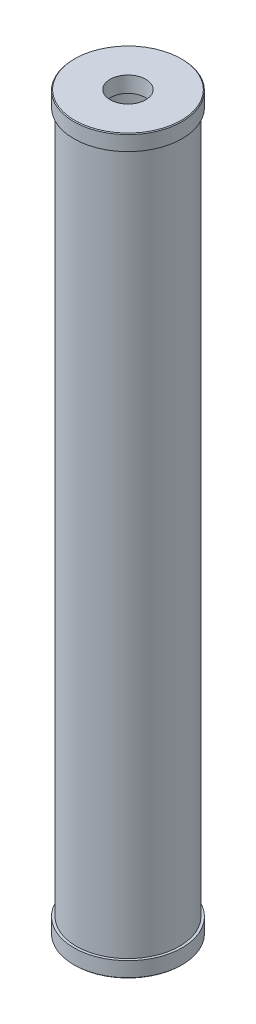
ISO-10303-21;
HEADER;
FILE_DESCRIPTION(('STEP AP214'),'2;1');
FILE_NAME('part.step','',(''),(''),'','','');
FILE_SCHEMA(('AUTOMOTIVE_DESIGN { 1 0 10303 214 1 1 1 1 }'));
ENDSEC;
DATA;
#1=APPLICATION_CONTEXT('core data for automotive mechanical design processes');
#2=APPLICATION_PROTOCOL_DEFINITION('international standard','automotive_design',2000,#1);
#3=PRODUCT_CONTEXT('',#1,'mechanical');
#4=PRODUCT('Part','Part','',(#3));
#5=PRODUCT_RELATED_PRODUCT_CATEGORY('part','',(#4));
#6=PRODUCT_DEFINITION_FORMATION('','',#4);
#7=PRODUCT_DEFINITION_CONTEXT('part definition',#1,'design');
#8=PRODUCT_DEFINITION('design','',#6,#7);
#9=PRODUCT_DEFINITION_SHAPE('','',#8);
#10=(LENGTH_UNIT() NAMED_UNIT(*) SI_UNIT(.MILLI.,.METRE.));
#11=(NAMED_UNIT(*) PLANE_ANGLE_UNIT() SI_UNIT($,.RADIAN.));
#12=(NAMED_UNIT(*) SI_UNIT($,.STERADIAN.) SOLID_ANGLE_UNIT());
#13=UNCERTAINTY_MEASURE_WITH_UNIT(LENGTH_MEASURE(1.E-05),#10,'distance_accuracy_value','');
#14=(GEOMETRIC_REPRESENTATION_CONTEXT(3) GLOBAL_UNCERTAINTY_ASSIGNED_CONTEXT((#13)) GLOBAL_UNIT_ASSIGNED_CONTEXT((#10,
#11,#12)) REPRESENTATION_CONTEXT('',''));
#15=CARTESIAN_POINT('',(0.,0.,0.));
#16=DIRECTION('',(0.,0.,1.));
#17=DIRECTION('',(1.,0.,0.));
#18=AXIS2_PLACEMENT_3D('',#15,#16,#17);
#19=CARTESIAN_POINT('',(0.,25.4,0.));
#20=DIRECTION('',(0.,1.,0.));
#21=DIRECTION('',(0.,0.,1.));
#22=AXIS2_PLACEMENT_3D('',#19,#20,#21);
#23=PLANE('',#22);
#24=CARTESIAN_POINT('',(0.,25.4,0.));
#25=DIRECTION('',(0.,1.,0.));
#26=DIRECTION('',(0.,0.,1.));
#27=AXIS2_PLACEMENT_3D('',#24,#25,#26);
#28=CIRCLE('',#27,28.2731618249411);
#29=CARTESIAN_POINT('',(0.,25.4,28.2731618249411));
#30=VERTEX_POINT('',#29);
#31=EDGE_CURVE('E77',#30,#30,#28,.T.);
#32=ORIENTED_EDGE('',*,*,#31,.F.);
#33=EDGE_LOOP('',(#32));
#34=FACE_BOUND('',#33,.T.);
#35=CARTESIAN_POINT('',(0.,25.4000000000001,0.));
#36=DIRECTION('',(0.,1.,0.));
#37=DIRECTION('',(0.,0.,1.));
#38=AXIS2_PLACEMENT_3D('',#35,#36,#37);
#39=CIRCLE('',#38,74.676);
#40=CARTESIAN_POINT('',(0.,25.4000000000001,74.676));
#41=VERTEX_POINT('',#40);
#42=EDGE_CURVE('E63',#41,#41,#39,.T.);
#43=ORIENTED_EDGE('',*,*,#42,.T.);
#44=EDGE_LOOP('',(#43));
#45=FACE_BOUND('',#44,.T.);
#46=ADVANCED_FACE('F33',(#34,#45),#23,.T.);
#47=CARTESIAN_POINT('',(0.,1193.8,0.));
#48=DIRECTION('',(0.,-1.,0.));
#49=DIRECTION('',(0.,0.,-1.));
#50=AXIS2_PLACEMENT_3D('',#47,#48,#49);
#51=CYLINDRICAL_SURFACE('',#50,74.676);
#52=ORIENTED_EDGE('',*,*,#42,.F.);
#53=EDGE_LOOP('',(#52));
#54=FACE_BOUND('',#53,.T.);
#55=CARTESIAN_POINT('',(0.,1168.4,0.));
#56=DIRECTION('',(0.,1.,0.));
#57=DIRECTION('',(0.,0.,1.));
#58=AXIS2_PLACEMENT_3D('',#55,#56,#57);
#59=CIRCLE('',#58,74.676);
#60=CARTESIAN_POINT('',(0.,1168.4,74.676));
#61=VERTEX_POINT('',#60);
#62=EDGE_CURVE('E59',#61,#61,#59,.T.);
#63=ORIENTED_EDGE('',*,*,#62,.T.);
#64=EDGE_LOOP('',(#63));
#65=FACE_BOUND('',#64,.T.);
#66=ADVANCED_FACE('F106',(#54,#65),#51,.F.);
#67=CARTESIAN_POINT('',(0.,1168.4,0.));
#68=DIRECTION('',(0.,1.,0.));
#69=DIRECTION('',(0.,0.,1.));
#70=AXIS2_PLACEMENT_3D('',#67,#68,#69);
#71=PLANE('',#70);
#72=CARTESIAN_POINT('',(0.,1168.4,0.));
#73=DIRECTION('',(0.,1.,0.));
#74=DIRECTION('',(0.,0.,1.));
#75=AXIS2_PLACEMENT_3D('',#72,#73,#74);
#76=CIRCLE('',#75,28.2731618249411);
#77=CARTESIAN_POINT('',(0.,1168.4,28.2731618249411));
#78=VERTEX_POINT('',#77);
#79=EDGE_CURVE('E54',#78,#78,#76,.T.);
#80=ORIENTED_EDGE('',*,*,#79,.T.);
#81=EDGE_LOOP('',(#80));
#82=FACE_BOUND('',#81,.T.);
#83=ORIENTED_EDGE('',*,*,#62,.F.);
#84=EDGE_LOOP('',(#83));
#85=FACE_BOUND('',#84,.T.);
#86=ADVANCED_FACE('F99',(#82,#85),#71,.F.);
#87=CARTESIAN_POINT('',(0.,1193.8,0.));
#88=DIRECTION('',(0.,1.,0.));
#89=DIRECTION('',(0.,0.,1.));
#90=AXIS2_PLACEMENT_3D('',#87,#88,#89);
#91=CONICAL_SURFACE('',#90,29.066064,0.0312064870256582);
#92=CARTESIAN_POINT('',(0.,1193.8,0.));
#93=DIRECTION('',(0.,1.,0.));
#94=DIRECTION('',(0.,0.,1.));
#95=AXIS2_PLACEMENT_3D('',#92,#93,#94);
#96=CIRCLE('',#95,29.066064);
#97=CARTESIAN_POINT('',(0.,1193.8,29.066064));
#98=VERTEX_POINT('',#97);
#99=EDGE_CURVE('E58',#98,#98,#96,.T.);
#100=ORIENTED_EDGE('',*,*,#99,.T.);
#101=EDGE_LOOP('',(#100));
#102=FACE_BOUND('',#101,.T.);
#103=ORIENTED_EDGE('',*,*,#79,.F.);
#104=EDGE_LOOP('',(#103));
#105=FACE_BOUND('',#104,.T.);
#106=ADVANCED_FACE('F123',(#102,#105),#91,.F.);
#107=CARTESIAN_POINT('',(0.,1193.8,0.));
#108=DIRECTION('',(0.,-1.,0.));
#109=DIRECTION('',(0.,0.,-1.));
#110=AXIS2_PLACEMENT_3D('',#107,#108,#109);
#111=CYLINDRICAL_SURFACE('',#110,84.201);
#112=CARTESIAN_POINT('',(0.,25.4000000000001,0.));
#113=DIRECTION('',(0.,1.,0.));
#114=DIRECTION('',(0.,0.,1.));
#115=AXIS2_PLACEMENT_3D('',#112,#113,#114);
#116=CIRCLE('',#115,84.201);
#117=CARTESIAN_POINT('',(0.,25.4000000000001,84.201));
#118=VERTEX_POINT('',#117);
#119=EDGE_CURVE('E66',#118,#118,#116,.T.);
#120=ORIENTED_EDGE('',*,*,#119,.T.);
#121=EDGE_LOOP('',(#120));
#122=FACE_BOUND('',#121,.T.);
#123=CARTESIAN_POINT('',(0.,1168.4,0.));
#124=DIRECTION('',(0.,1.,0.));
#125=DIRECTION('',(0.,0.,1.));
#126=AXIS2_PLACEMENT_3D('',#123,#124,#125);
#127=CIRCLE('',#126,84.201);
#128=CARTESIAN_POINT('',(0.,1168.4,84.201));
#129=VERTEX_POINT('',#128);
#130=EDGE_CURVE('E53',#129,#129,#127,.T.);
#131=ORIENTED_EDGE('',*,*,#130,.F.);
#132=EDGE_LOOP('',(#131));
#133=FACE_BOUND('',#132,.T.);
#134=ADVANCED_FACE('F118',(#122,#133),#111,.T.);
#135=CARTESIAN_POINT('',(0.,25.4,0.));
#136=DIRECTION('',(0.,1.,0.));
#137=DIRECTION('',(0.,0.,1.));
#138=AXIS2_PLACEMENT_3D('',#135,#136,#137);
#139=CIRCLE('',#138,88.265);
#140=CARTESIAN_POINT('',(0.,25.4,88.265));
#141=VERTEX_POINT('',#140);
#142=EDGE_CURVE('E62',#141,#141,#139,.T.);
#143=ORIENTED_EDGE('',*,*,#142,.T.);
#144=EDGE_LOOP('',(#143));
#145=FACE_BOUND('',#144,.T.);
#146=ORIENTED_EDGE('',*,*,#119,.F.);
#147=EDGE_LOOP('',(#146));
#148=FACE_BOUND('',#147,.T.);
#149=ADVANCED_FACE('F100',(#145,#148),#23,.T.);
#150=CARTESIAN_POINT('',(0.,25.4,0.));
#151=DIRECTION('',(0.,-1.,0.));
#152=DIRECTION('',(0.,0.,-1.));
#153=AXIS2_PLACEMENT_3D('',#150,#151,#152);
#154=CYLINDRICAL_SURFACE('',#153,88.265);
#155=CARTESIAN_POINT('',(0.,1.27000000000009,0.));
#156=DIRECTION('',(0.,1.,0.));
#157=DIRECTION('',(0.,0.,1.));
#158=AXIS2_PLACEMENT_3D('',#155,#156,#157);
#159=CIRCLE('',#158,88.265);
#160=CARTESIAN_POINT('',(0.,1.27000000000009,88.265));
#161=VERTEX_POINT('',#160);
#162=EDGE_CURVE('E48',#161,#161,#159,.T.);
#163=ORIENTED_EDGE('',*,*,#162,.T.);
#164=EDGE_LOOP('',(#163));
#165=FACE_BOUND('',#164,.T.);
#166=ORIENTED_EDGE('',*,*,#142,.F.);
#167=EDGE_LOOP('',(#166));
#168=FACE_BOUND('',#167,.T.);
#169=ADVANCED_FACE('F89',(#165,#168),#154,.T.);
#170=CARTESIAN_POINT('',(0.,0.,0.));
#171=DIRECTION('',(0.,1.,0.));
#172=DIRECTION('',(0.,0.,1.));
#173=AXIS2_PLACEMENT_3D('',#170,#171,#172);
#174=PLANE('',#173);
#175=CARTESIAN_POINT('',(0.,0.,0.));
#176=DIRECTION('',(0.,1.,0.));
#177=DIRECTION('',(0.,0.,1.));
#178=AXIS2_PLACEMENT_3D('',#175,#176,#177);
#179=CIRCLE('',#178,86.9949999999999);
#180=CARTESIAN_POINT('',(0.,0.,86.9949999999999));
#181=VERTEX_POINT('',#180);
#182=EDGE_CURVE('E44',#181,#181,#179,.F.);
#183=ORIENTED_EDGE('',*,*,#182,.T.);
#184=EDGE_LOOP('',(#183));
#185=FACE_BOUND('',#184,.T.);
#186=CARTESIAN_POINT('',(0.,0.,0.));
#187=DIRECTION('',(0.,-1.,0.));
#188=DIRECTION('',(0.,0.,-1.));
#189=AXIS2_PLACEMENT_3D('',#186,#187,#188);
#190=CIRCLE('',#189,29.066064);
#191=CARTESIAN_POINT('',(0.,0.,-29.066064));
#192=VERTEX_POINT('',#191);
#193=EDGE_CURVE('E80',#192,#192,#190,.T.);
#194=ORIENTED_EDGE('',*,*,#193,.F.);
#195=EDGE_LOOP('',(#194));
#196=FACE_BOUND('',#195,.T.);
#197=ADVANCED_FACE('F86',(#185,#196),#174,.F.);
#198=CARTESIAN_POINT('',(0.,1168.4,0.));
#199=DIRECTION('',(0.,1.,0.));
#200=DIRECTION('',(0.,0.,1.));
#201=AXIS2_PLACEMENT_3D('',#198,#199,#200);
#202=CIRCLE('',#201,88.265);
#203=CARTESIAN_POINT('',(0.,1168.4,88.265));
#204=VERTEX_POINT('',#203);
#205=EDGE_CURVE('E57',#204,#204,#202,.T.);
#206=ORIENTED_EDGE('',*,*,#205,.F.);
#207=EDGE_LOOP('',(#206));
#208=FACE_BOUND('',#207,.T.);
#209=ORIENTED_EDGE('',*,*,#130,.T.);
#210=EDGE_LOOP('',(#209));
#211=FACE_BOUND('',#210,.T.);
#212=ADVANCED_FACE('F88',(#208,#211),#71,.F.);
#213=CARTESIAN_POINT('',(0.,1168.4,0.));
#214=DIRECTION('',(0.,1.,0.));
#215=DIRECTION('',(0.,0.,1.));
#216=AXIS2_PLACEMENT_3D('',#213,#214,#215);
#217=CYLINDRICAL_SURFACE('',#216,88.265);
#218=CARTESIAN_POINT('',(0.,1192.53,0.));
#219=DIRECTION('',(0.,1.,0.));
#220=DIRECTION('',(0.,0.,1.));
#221=AXIS2_PLACEMENT_3D('',#218,#219,#220);
#222=CIRCLE('',#221,88.265);
#223=CARTESIAN_POINT('',(0.,1192.53,88.265));
#224=VERTEX_POINT('',#223);
#225=EDGE_CURVE('E10',#224,#224,#222,.F.);
#226=ORIENTED_EDGE('',*,*,#225,.T.);
#227=EDGE_LOOP('',(#226));
#228=FACE_BOUND('',#227,.T.);
#229=ORIENTED_EDGE('',*,*,#205,.T.);
#230=EDGE_LOOP('',(#229));
#231=FACE_BOUND('',#230,.T.);
#232=ADVANCED_FACE('F96',(#228,#231),#217,.T.);
#233=CARTESIAN_POINT('',(0.,1193.8,0.));
#234=DIRECTION('',(0.,1.,0.));
#235=DIRECTION('',(0.,0.,1.));
#236=AXIS2_PLACEMENT_3D('',#233,#234,#235);
#237=PLANE('',#236);
#238=CARTESIAN_POINT('',(0.,1193.8,0.));
#239=DIRECTION('',(0.,1.,0.));
#240=DIRECTION('',(0.,0.,1.));
#241=AXIS2_PLACEMENT_3D('',#238,#239,#240);
#242=CIRCLE('',#241,86.995);
#243=CARTESIAN_POINT('',(0.,1193.8,86.995));
#244=VERTEX_POINT('',#243);
#245=EDGE_CURVE('E40',#244,#244,#242,.T.);
#246=ORIENTED_EDGE('',*,*,#245,.T.);
#247=EDGE_LOOP('',(#246));
#248=FACE_BOUND('',#247,.T.);
#249=ORIENTED_EDGE('',*,*,#99,.F.);
#250=EDGE_LOOP('',(#249));
#251=FACE_BOUND('',#250,.T.);
#252=ADVANCED_FACE('F145',(#248,#251),#237,.T.);
#253=CARTESIAN_POINT('',(0.,0.,0.));
#254=DIRECTION('',(0.,-1.,0.));
#255=DIRECTION('',(0.,0.,-1.));
#256=AXIS2_PLACEMENT_3D('',#253,#254,#255);
#257=CONICAL_SURFACE('',#256,29.066064,0.0312064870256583);
#258=ORIENTED_EDGE('',*,*,#31,.T.);
#259=EDGE_LOOP('',(#258));
#260=FACE_BOUND('',#259,.T.);
#261=ORIENTED_EDGE('',*,*,#193,.T.);
#262=EDGE_LOOP('',(#261));
#263=FACE_BOUND('',#262,.T.);
#264=ADVANCED_FACE('F84',(#260,#263),#257,.F.);
#265=CARTESIAN_POINT('',(0.,1.27000000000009,0.));
#266=DIRECTION('',(0.,1.,0.));
#267=DIRECTION('',(0.,0.,1.));
#268=AXIS2_PLACEMENT_3D('',#265,#266,#267);
#269=CONICAL_SURFACE('',#268,88.265,0.785398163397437);
#270=ORIENTED_EDGE('',*,*,#182,.F.);
#271=EDGE_LOOP('',(#270));
#272=FACE_BOUND('',#271,.T.);
#273=ORIENTED_EDGE('',*,*,#162,.F.);
#274=EDGE_LOOP('',(#273));
#275=FACE_BOUND('',#274,.T.);
#276=ADVANCED_FACE('F137',(#272,#275),#269,.T.);
#277=CARTESIAN_POINT('',(0.,1193.8,0.));
#278=DIRECTION('',(0.,-1.,0.));
#279=DIRECTION('',(0.,0.,-1.));
#280=AXIS2_PLACEMENT_3D('',#277,#278,#279);
#281=CONICAL_SURFACE('',#280,86.995,0.785398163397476);
#282=ORIENTED_EDGE('',*,*,#225,.F.);
#283=EDGE_LOOP('',(#282));
#284=FACE_BOUND('',#283,.T.);
#285=ORIENTED_EDGE('',*,*,#245,.F.);
#286=EDGE_LOOP('',(#285));
#287=FACE_BOUND('',#286,.T.);
#288=ADVANCED_FACE('F35',(#284,#287),#281,.T.);
#289=CLOSED_SHELL('',(#46,#66,#86,#106,#134,#149,#169,#197,#212,#232,#252,#264,#276,#288));
#290=MANIFOLD_SOLID_BREP('B2',#289);
#291=ADVANCED_BREP_SHAPE_REPRESENTATION('',(#18,#290),#14);
#292=SHAPE_DEFINITION_REPRESENTATION(#9,#291);
ENDSEC;
END-ISO-10303-21;
